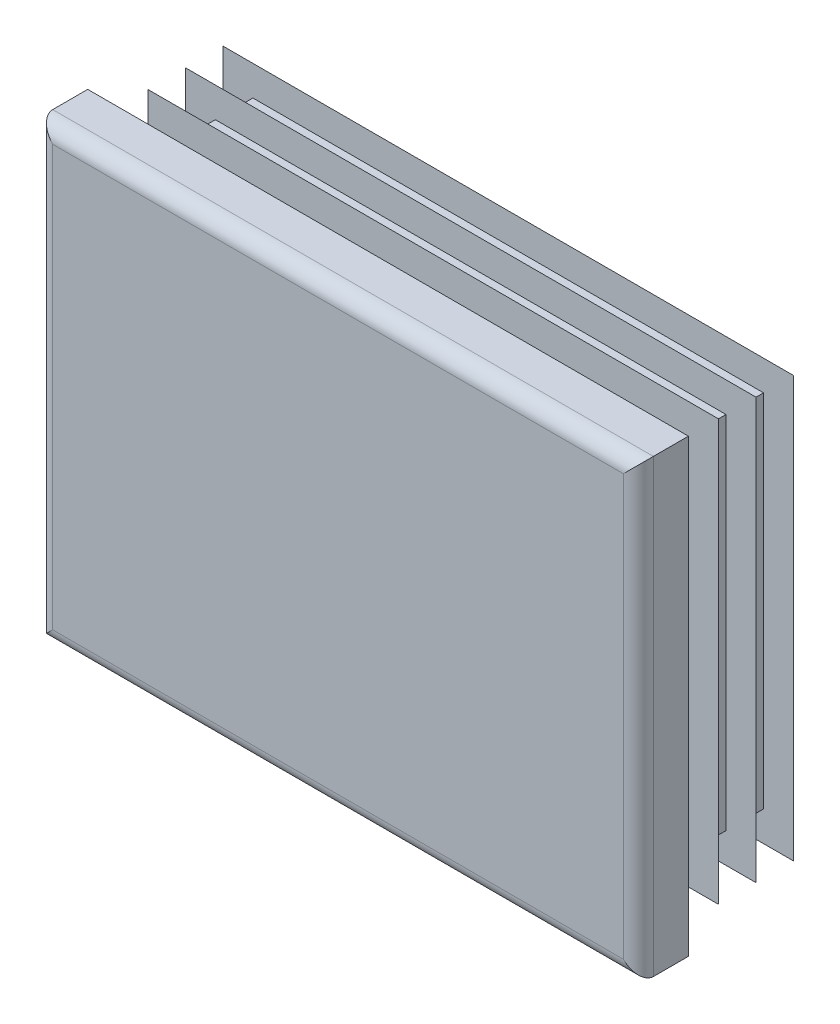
ISO-10303-21;
HEADER;
FILE_DESCRIPTION(('STEP AP214'),'2;1');
FILE_NAME('part.step','',(''),(''),'','','');
FILE_SCHEMA(('AUTOMOTIVE_DESIGN { 1 0 10303 214 1 1 1 1 }'));
ENDSEC;
DATA;
#1=APPLICATION_CONTEXT('core data for automotive mechanical design processes');
#2=APPLICATION_PROTOCOL_DEFINITION('international standard','automotive_design',2000,#1);
#3=PRODUCT_CONTEXT('',#1,'mechanical');
#4=PRODUCT('Part','Part','',(#3));
#5=PRODUCT_RELATED_PRODUCT_CATEGORY('part','',(#4));
#6=PRODUCT_DEFINITION_FORMATION('','',#4);
#7=PRODUCT_DEFINITION_CONTEXT('part definition',#1,'design');
#8=PRODUCT_DEFINITION('design','',#6,#7);
#9=PRODUCT_DEFINITION_SHAPE('','',#8);
#10=(LENGTH_UNIT() NAMED_UNIT(*) SI_UNIT(.MILLI.,.METRE.));
#11=(NAMED_UNIT(*) PLANE_ANGLE_UNIT() SI_UNIT($,.RADIAN.));
#12=(NAMED_UNIT(*) SI_UNIT($,.STERADIAN.) SOLID_ANGLE_UNIT());
#13=UNCERTAINTY_MEASURE_WITH_UNIT(LENGTH_MEASURE(1.E-05),#10,'distance_accuracy_value','');
#14=(GEOMETRIC_REPRESENTATION_CONTEXT(3) GLOBAL_UNCERTAINTY_ASSIGNED_CONTEXT((#13)) GLOBAL_UNIT_ASSIGNED_CONTEXT((#10,
#11,#12)) REPRESENTATION_CONTEXT('',''));
#15=CARTESIAN_POINT('',(0.,0.,0.));
#16=DIRECTION('',(0.,0.,1.));
#17=DIRECTION('',(1.,0.,0.));
#18=AXIS2_PLACEMENT_3D('',#15,#16,#17);
#19=CARTESIAN_POINT('',(28.5,-22.5,5.));
#20=DIRECTION('',(0.,0.,-1.));
#21=DIRECTION('',(0.,1.,0.));
#22=AXIS2_PLACEMENT_3D('',#19,#20,#21);
#23=PLANE('',#22);
#24=DIRECTION('',(0.,1.,0.));
#25=VECTOR('',#24,1.);
#26=CARTESIAN_POINT('',(-28.5,-22.5,5.));
#27=LINE('',#26,#25);
#28=CARTESIAN_POINT('',(-28.5,-21.,5.));
#29=VERTEX_POINT('',#28);
#30=CARTESIAN_POINT('',(-28.5,21.,5.));
#31=VERTEX_POINT('',#30);
#32=EDGE_CURVE('E310',#29,#31,#27,.T.);
#33=ORIENTED_EDGE('',*,*,#32,.F.);
#34=DIRECTION('',(-1.,0.,0.));
#35=VECTOR('',#34,1.);
#36=CARTESIAN_POINT('',(30.,-21.,5.));
#37=LINE('',#36,#35);
#38=CARTESIAN_POINT('',(28.5,-21.,5.));
#39=VERTEX_POINT('',#38);
#40=EDGE_CURVE('E482',#39,#29,#37,.T.);
#41=ORIENTED_EDGE('',*,*,#40,.F.);
#42=DIRECTION('',(0.,1.,0.));
#43=VECTOR('',#42,1.);
#44=CARTESIAN_POINT('',(28.5,-22.5,5.));
#45=LINE('',#44,#43);
#46=CARTESIAN_POINT('',(28.5,21.,5.));
#47=VERTEX_POINT('',#46);
#48=EDGE_CURVE('E305',#39,#47,#45,.T.);
#49=ORIENTED_EDGE('',*,*,#48,.T.);
#50=DIRECTION('',(-1.,0.,0.));
#51=VECTOR('',#50,1.);
#52=CARTESIAN_POINT('',(30.,21.,5.));
#53=LINE('',#52,#51);
#54=EDGE_CURVE('E630',#47,#31,#53,.T.);
#55=ORIENTED_EDGE('',*,*,#54,.T.);
#56=EDGE_LOOP('',(#33,#41,#49,#55));
#57=FACE_BOUND('',#56,.T.);
#58=ADVANCED_FACE('F14',(#57),#23,.F.);
#59=CARTESIAN_POINT('',(-28.5,-22.5,3.5));
#60=DIRECTION('',(0.,1.,0.));
#61=DIRECTION('',(-1.,0.,0.));
#62=AXIS2_PLACEMENT_3D('',#59,#60,#61);
#63=CYLINDRICAL_SURFACE('',#62,1.5);
#64=DIRECTION('',(0.,1.,0.));
#65=VECTOR('',#64,1.);
#66=CARTESIAN_POINT('',(-30.,-22.5,3.5));
#67=LINE('',#66,#65);
#68=CARTESIAN_POINT('',(-30.,-22.5,3.5));
#69=VERTEX_POINT('',#68);
#70=CARTESIAN_POINT('',(-30.,22.5,3.5));
#71=VERTEX_POINT('',#70);
#72=EDGE_CURVE('E402',#69,#71,#67,.T.);
#73=ORIENTED_EDGE('',*,*,#72,.F.);
#74=CARTESIAN_POINT('',(-28.5,-21.,3.5));
#75=DIRECTION('',(-0.707106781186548,0.707106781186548,0.));
#76=DIRECTION('',(0.707106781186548,0.707106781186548,0.));
#77=AXIS2_PLACEMENT_3D('',#74,#75,#76);
#78=ELLIPSE('',#77,2.12132034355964,1.5);
#79=EDGE_CURVE('E59',#69,#29,#78,.T.);
#80=ORIENTED_EDGE('',*,*,#79,.T.);
#81=ORIENTED_EDGE('',*,*,#32,.T.);
#82=CARTESIAN_POINT('',(-28.5,21.,3.5));
#83=DIRECTION('',(0.707106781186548,0.707106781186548,0.));
#84=DIRECTION('',(-0.707106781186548,0.707106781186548,0.));
#85=AXIS2_PLACEMENT_3D('',#82,#83,#84);
#86=ELLIPSE('',#85,2.12132034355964,1.5);
#87=EDGE_CURVE('E306',#31,#71,#86,.F.);
#88=ORIENTED_EDGE('',*,*,#87,.T.);
#89=EDGE_LOOP('',(#73,#80,#81,#88));
#90=FACE_BOUND('',#89,.T.);
#91=ADVANCED_FACE('F16',(#90),#63,.T.);
#92=CARTESIAN_POINT('',(-30.,-22.5,3.5));
#93=DIRECTION('',(1.,0.,0.));
#94=DIRECTION('',(0.,1.,0.));
#95=AXIS2_PLACEMENT_3D('',#92,#93,#94);
#96=PLANE('',#95);
#97=DIRECTION('',(0.,0.,-1.));
#98=VECTOR('',#97,1.);
#99=CARTESIAN_POINT('',(-30.,22.5,3.5));
#100=LINE('',#99,#98);
#101=CARTESIAN_POINT('',(-30.,22.5,0.));
#102=VERTEX_POINT('',#101);
#103=EDGE_CURVE('E615',#71,#102,#100,.T.);
#104=ORIENTED_EDGE('',*,*,#103,.T.);
#105=DIRECTION('',(0.,1.,0.));
#106=VECTOR('',#105,1.);
#107=CARTESIAN_POINT('',(-30.,-22.5,0.));
#108=LINE('',#107,#106);
#109=CARTESIAN_POINT('',(-30.,-22.5,0.));
#110=VERTEX_POINT('',#109);
#111=EDGE_CURVE('E400',#110,#102,#108,.T.);
#112=ORIENTED_EDGE('',*,*,#111,.F.);
#113=DIRECTION('',(0.,0.,-1.));
#114=VECTOR('',#113,1.);
#115=CARTESIAN_POINT('',(-30.,-22.5,3.5));
#116=LINE('',#115,#114);
#117=EDGE_CURVE('E616',#69,#110,#116,.T.);
#118=ORIENTED_EDGE('',*,*,#117,.F.);
#119=ORIENTED_EDGE('',*,*,#72,.T.);
#120=EDGE_LOOP('',(#104,#112,#118,#119));
#121=FACE_BOUND('',#120,.T.);
#122=ADVANCED_FACE('F697',(#121),#96,.F.);
#123=CARTESIAN_POINT('',(-25.5,-22.5,0.));
#124=DIRECTION('',(1.,0.,0.));
#125=DIRECTION('',(0.,1.,0.));
#126=AXIS2_PLACEMENT_3D('',#123,#124,#125);
#127=PLANE('',#126);
#128=DIRECTION('',(0.,1.,0.));
#129=VECTOR('',#128,1.);
#130=CARTESIAN_POINT('',(-25.5,-22.5,0.));
#131=LINE('',#130,#129);
#132=CARTESIAN_POINT('',(-25.5,-18.,0.));
#133=VERTEX_POINT('',#132);
#134=CARTESIAN_POINT('',(-25.5,18.,0.));
#135=VERTEX_POINT('',#134);
#136=EDGE_CURVE('E397',#133,#135,#131,.T.);
#137=ORIENTED_EDGE('',*,*,#136,.T.);
#138=DIRECTION('',(0.,0.,-1.));
#139=VECTOR('',#138,1.);
#140=CARTESIAN_POINT('',(-25.5,18.,0.));
#141=LINE('',#140,#139);
#142=CARTESIAN_POINT('',(-25.5,18.,-0.75));
#143=VERTEX_POINT('',#142);
#144=EDGE_CURVE('E495',#135,#143,#141,.T.);
#145=ORIENTED_EDGE('',*,*,#144,.T.);
#146=DIRECTION('',(0.,1.,0.));
#147=VECTOR('',#146,1.);
#148=CARTESIAN_POINT('',(-25.5,-22.5,-0.75));
#149=LINE('',#148,#147);
#150=CARTESIAN_POINT('',(-25.5,-18.,-0.75));
#151=VERTEX_POINT('',#150);
#152=EDGE_CURVE('E394',#151,#143,#149,.T.);
#153=ORIENTED_EDGE('',*,*,#152,.F.);
#154=DIRECTION('',(0.,0.,1.));
#155=VECTOR('',#154,1.);
#156=CARTESIAN_POINT('',(-25.5,-18.,0.));
#157=LINE('',#156,#155);
#158=EDGE_CURVE('E489',#151,#133,#157,.T.);
#159=ORIENTED_EDGE('',*,*,#158,.T.);
#160=EDGE_LOOP('',(#137,#145,#153,#159));
#161=FACE_BOUND('',#160,.T.);
#162=ADVANCED_FACE('F787',(#161),#127,.F.);
#163=CARTESIAN_POINT('',(-28.5,-22.5,-0.75));
#164=DIRECTION('',(0.342020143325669,0.,0.939692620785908));
#165=DIRECTION('',(-0.939692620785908,0.,0.342020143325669));
#166=AXIS2_PLACEMENT_3D('',#163,#164,#165);
#167=PLANE('',#166);
#168=DIRECTION('',(0.,1.,0.));
#169=VECTOR('',#168,1.);
#170=CARTESIAN_POINT('',(-28.5,-22.5,-0.75));
#171=LINE('',#170,#169);
#172=CARTESIAN_POINT('',(-28.5,-21.,-0.75));
#173=VERTEX_POINT('',#172);
#174=CARTESIAN_POINT('',(-28.5,21.,-0.75));
#175=VERTEX_POINT('',#174);
#176=EDGE_CURVE('E392',#173,#175,#171,.T.);
#177=ORIENTED_EDGE('',*,*,#176,.T.);
#178=DIRECTION('',(0.844349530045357,-0.438895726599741,-0.307318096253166));
#179=VECTOR('',#178,1.);
#180=CARTESIAN_POINT('',(-12.3797090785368,12.6206185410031,-6.6173060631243));
#181=LINE('',#180,#179);
#182=CARTESIAN_POINT('',(-25.5,19.4405899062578,-1.84191070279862));
#183=VERTEX_POINT('',#182);
#184=EDGE_CURVE('E519',#175,#183,#181,.T.);
#185=ORIENTED_EDGE('',*,*,#184,.T.);
#186=DIRECTION('',(0.,1.,0.));
#187=VECTOR('',#186,1.);
#188=CARTESIAN_POINT('',(-25.5,-22.5,-1.84191070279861));
#189=LINE('',#188,#187);
#190=CARTESIAN_POINT('',(-25.5,-19.4405899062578,-1.84191070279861));
#191=VERTEX_POINT('',#190);
#192=EDGE_CURVE('E389',#191,#183,#189,.T.);
#193=ORIENTED_EDGE('',*,*,#192,.F.);
#194=DIRECTION('',(-0.844349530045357,-0.438895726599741,0.307318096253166));
#195=VECTOR('',#194,1.);
#196=CARTESIAN_POINT('',(-29.0558721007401,-21.2889441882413,-0.547679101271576));
#197=LINE('',#196,#195);
#198=EDGE_CURVE('E507',#191,#173,#197,.T.);
#199=ORIENTED_EDGE('',*,*,#198,.T.);
#200=EDGE_LOOP('',(#177,#185,#193,#199));
#201=FACE_BOUND('',#200,.T.);
#202=ADVANCED_FACE('F783',(#201),#167,.F.);
#203=CARTESIAN_POINT('',(-25.5,-22.5,-1.84191070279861));
#204=DIRECTION('',(1.,0.,0.));
#205=DIRECTION('',(0.,1.,0.));
#206=AXIS2_PLACEMENT_3D('',#203,#204,#205);
#207=PLANE('',#206);
#208=ORIENTED_EDGE('',*,*,#192,.T.);
#209=DIRECTION('',(0.,-0.819152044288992,-0.573576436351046));
#210=VECTOR('',#209,1.);
#211=CARTESIAN_POINT('',(-25.5,-8.7019683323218,-21.5475421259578));
#212=LINE('',#211,#210);
#213=CARTESIAN_POINT('',(-25.5,18.,-2.85062261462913));
#214=VERTEX_POINT('',#213);
#215=EDGE_CURVE('E516',#183,#214,#212,.T.);
#216=ORIENTED_EDGE('',*,*,#215,.T.);
#217=DIRECTION('',(0.,0.,-1.));
#218=VECTOR('',#217,1.);
#219=CARTESIAN_POINT('',(-25.5,18.,-1.84191070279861));
#220=LINE('',#219,#218);
#221=CARTESIAN_POINT('',(-25.5,18.,-4.5));
#222=VERTEX_POINT('',#221);
#223=EDGE_CURVE('E525',#214,#222,#220,.T.);
#224=ORIENTED_EDGE('',*,*,#223,.T.);
#225=DIRECTION('',(0.,1.,0.));
#226=VECTOR('',#225,1.);
#227=CARTESIAN_POINT('',(-25.5,-22.5,-4.5));
#228=LINE('',#227,#226);
#229=CARTESIAN_POINT('',(-25.5,-18.,-4.5));
#230=VERTEX_POINT('',#229);
#231=EDGE_CURVE('E386',#230,#222,#228,.T.);
#232=ORIENTED_EDGE('',*,*,#231,.F.);
#233=DIRECTION('',(0.,0.,1.));
#234=VECTOR('',#233,1.);
#235=CARTESIAN_POINT('',(-25.5,-18.,-1.84191070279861));
#236=LINE('',#235,#234);
#237=CARTESIAN_POINT('',(-25.5,-18.,-2.85062261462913));
#238=VERTEX_POINT('',#237);
#239=EDGE_CURVE('E522',#230,#238,#236,.T.);
#240=ORIENTED_EDGE('',*,*,#239,.T.);
#241=DIRECTION('',(0.,-0.819152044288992,0.573576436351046));
#242=VECTOR('',#241,1.);
#243=CARTESIAN_POINT('',(-25.5,-21.4934848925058,-0.404458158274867));
#244=LINE('',#243,#242);
#245=EDGE_CURVE('E504',#238,#191,#244,.T.);
#246=ORIENTED_EDGE('',*,*,#245,.T.);
#247=EDGE_LOOP('',(#208,#216,#224,#232,#240,#246));
#248=FACE_BOUND('',#247,.T.);
#249=ADVANCED_FACE('F779',(#248),#207,.F.);
#250=CARTESIAN_POINT('',(-28.5,-22.5,-4.5));
#251=DIRECTION('',(0.342020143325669,0.,0.939692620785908));
#252=DIRECTION('',(-0.939692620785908,0.,0.342020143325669));
#253=AXIS2_PLACEMENT_3D('',#250,#251,#252);
#254=PLANE('',#253);
#255=DIRECTION('',(0.,1.,0.));
#256=VECTOR('',#255,1.);
#257=CARTESIAN_POINT('',(-28.5,-22.5,-4.5));
#258=LINE('',#257,#256);
#259=CARTESIAN_POINT('',(-28.5,-21.,-4.5));
#260=VERTEX_POINT('',#259);
#261=CARTESIAN_POINT('',(-28.5,21.,-4.5));
#262=VERTEX_POINT('',#261);
#263=EDGE_CURVE('E384',#260,#262,#258,.T.);
#264=ORIENTED_EDGE('',*,*,#263,.T.);
#265=DIRECTION('',(0.844349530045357,-0.438895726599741,-0.307318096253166));
#266=VECTOR('',#265,1.);
#267=CARTESIAN_POINT('',(-12.3797090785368,12.6206185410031,-10.3673060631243));
#268=LINE('',#267,#266);
#269=CARTESIAN_POINT('',(-25.5,19.4405899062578,-5.59191070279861));
#270=VERTEX_POINT('',#269);
#271=EDGE_CURVE('E549',#262,#270,#268,.T.);
#272=ORIENTED_EDGE('',*,*,#271,.T.);
#273=DIRECTION('',(0.,1.,0.));
#274=VECTOR('',#273,1.);
#275=CARTESIAN_POINT('',(-25.5,-22.5,-5.59191070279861));
#276=LINE('',#275,#274);
#277=CARTESIAN_POINT('',(-25.5,-19.4405899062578,-5.59191070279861));
#278=VERTEX_POINT('',#277);
#279=EDGE_CURVE('E381',#278,#270,#276,.T.);
#280=ORIENTED_EDGE('',*,*,#279,.F.);
#281=DIRECTION('',(-0.844349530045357,-0.43889572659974,0.307318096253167));
#282=VECTOR('',#281,1.);
#283=CARTESIAN_POINT('',(-29.0558721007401,-21.2889441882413,-4.29767910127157));
#284=LINE('',#283,#282);
#285=EDGE_CURVE('E537',#278,#260,#284,.T.);
#286=ORIENTED_EDGE('',*,*,#285,.T.);
#287=EDGE_LOOP('',(#264,#272,#280,#286));
#288=FACE_BOUND('',#287,.T.);
#289=ADVANCED_FACE('F775',(#288),#254,.F.);
#290=CARTESIAN_POINT('',(-25.5,-22.5,-5.59191070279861));
#291=DIRECTION('',(1.,0.,0.));
#292=DIRECTION('',(0.,1.,0.));
#293=AXIS2_PLACEMENT_3D('',#290,#291,#292);
#294=PLANE('',#293);
#295=ORIENTED_EDGE('',*,*,#279,.T.);
#296=DIRECTION('',(0.,-0.819152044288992,-0.573576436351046));
#297=VECTOR('',#296,1.);
#298=CARTESIAN_POINT('',(-25.5,-8.7019683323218,-25.2975421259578));
#299=LINE('',#298,#297);
#300=CARTESIAN_POINT('',(-25.5,18.,-6.60062261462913));
#301=VERTEX_POINT('',#300);
#302=EDGE_CURVE('E546',#270,#301,#299,.T.);
#303=ORIENTED_EDGE('',*,*,#302,.T.);
#304=DIRECTION('',(0.,0.,-1.));
#305=VECTOR('',#304,1.);
#306=CARTESIAN_POINT('',(-25.5,18.,-5.59191070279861));
#307=LINE('',#306,#305);
#308=CARTESIAN_POINT('',(-25.5,18.,-8.25));
#309=VERTEX_POINT('',#308);
#310=EDGE_CURVE('E555',#301,#309,#307,.T.);
#311=ORIENTED_EDGE('',*,*,#310,.T.);
#312=DIRECTION('',(0.,1.,0.));
#313=VECTOR('',#312,1.);
#314=CARTESIAN_POINT('',(-25.5,-22.5,-8.25));
#315=LINE('',#314,#313);
#316=CARTESIAN_POINT('',(-25.5,-18.,-8.25));
#317=VERTEX_POINT('',#316);
#318=EDGE_CURVE('E378',#317,#309,#315,.T.);
#319=ORIENTED_EDGE('',*,*,#318,.F.);
#320=DIRECTION('',(0.,0.,1.));
#321=VECTOR('',#320,1.);
#322=CARTESIAN_POINT('',(-25.5,-18.,-5.59191070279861));
#323=LINE('',#322,#321);
#324=CARTESIAN_POINT('',(-25.5,-18.,-6.60062261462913));
#325=VERTEX_POINT('',#324);
#326=EDGE_CURVE('E552',#317,#325,#323,.T.);
#327=ORIENTED_EDGE('',*,*,#326,.T.);
#328=DIRECTION('',(0.,-0.819152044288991,0.573576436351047));
#329=VECTOR('',#328,1.);
#330=CARTESIAN_POINT('',(-25.5,-21.4934848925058,-4.15445815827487));
#331=LINE('',#330,#329);
#332=EDGE_CURVE('E534',#325,#278,#331,.T.);
#333=ORIENTED_EDGE('',*,*,#332,.T.);
#334=EDGE_LOOP('',(#295,#303,#311,#319,#327,#333));
#335=FACE_BOUND('',#334,.T.);
#336=ADVANCED_FACE('F771',(#335),#294,.F.);
#337=CARTESIAN_POINT('',(-28.5,-22.5,-8.25));
#338=DIRECTION('',(0.342020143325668,0.,0.939692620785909));
#339=DIRECTION('',(-0.939692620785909,0.,0.342020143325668));
#340=AXIS2_PLACEMENT_3D('',#337,#338,#339);
#341=PLANE('',#340);
#342=DIRECTION('',(0.,1.,0.));
#343=VECTOR('',#342,1.);
#344=CARTESIAN_POINT('',(-28.5,-22.5,-8.25));
#345=LINE('',#344,#343);
#346=CARTESIAN_POINT('',(-28.5,-21.,-8.25));
#347=VERTEX_POINT('',#346);
#348=CARTESIAN_POINT('',(-28.5,21.,-8.25));
#349=VERTEX_POINT('',#348);
#350=EDGE_CURVE('E376',#347,#349,#345,.T.);
#351=ORIENTED_EDGE('',*,*,#350,.T.);
#352=DIRECTION('',(0.844349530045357,-0.43889572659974,-0.307318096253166));
#353=VECTOR('',#352,1.);
#354=CARTESIAN_POINT('',(-12.3797090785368,12.6206185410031,-14.1173060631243));
#355=LINE('',#354,#353);
#356=CARTESIAN_POINT('',(-25.5,19.4405899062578,-9.34191070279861));
#357=VERTEX_POINT('',#356);
#358=EDGE_CURVE('E579',#349,#357,#355,.T.);
#359=ORIENTED_EDGE('',*,*,#358,.T.);
#360=DIRECTION('',(0.,1.,0.));
#361=VECTOR('',#360,1.);
#362=CARTESIAN_POINT('',(-25.5,-22.5,-9.3419107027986));
#363=LINE('',#362,#361);
#364=CARTESIAN_POINT('',(-25.5,-19.4405899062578,-9.3419107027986));
#365=VERTEX_POINT('',#364);
#366=EDGE_CURVE('E373',#365,#357,#363,.T.);
#367=ORIENTED_EDGE('',*,*,#366,.F.);
#368=DIRECTION('',(-0.844349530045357,-0.43889572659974,0.307318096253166));
#369=VECTOR('',#368,1.);
#370=CARTESIAN_POINT('',(-29.0558721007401,-21.2889441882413,-8.04767910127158));
#371=LINE('',#370,#369);
#372=EDGE_CURVE('E567',#365,#347,#371,.T.);
#373=ORIENTED_EDGE('',*,*,#372,.T.);
#374=EDGE_LOOP('',(#351,#359,#367,#373));
#375=FACE_BOUND('',#374,.T.);
#376=ADVANCED_FACE('F767',(#375),#341,.F.);
#377=CARTESIAN_POINT('',(-25.5,-22.5,-9.3419107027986));
#378=DIRECTION('',(1.,0.,0.));
#379=DIRECTION('',(0.,1.,0.));
#380=AXIS2_PLACEMENT_3D('',#377,#378,#379);
#381=PLANE('',#380);
#382=ORIENTED_EDGE('',*,*,#366,.T.);
#383=DIRECTION('',(0.,-0.819152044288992,-0.573576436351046));
#384=VECTOR('',#383,1.);
#385=CARTESIAN_POINT('',(-25.5,-8.70196833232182,-29.0475421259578));
#386=LINE('',#385,#384);
#387=CARTESIAN_POINT('',(-25.5,18.,-10.3506226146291));
#388=VERTEX_POINT('',#387);
#389=EDGE_CURVE('E576',#357,#388,#386,.T.);
#390=ORIENTED_EDGE('',*,*,#389,.T.);
#391=DIRECTION('',(0.,0.,-1.));
#392=VECTOR('',#391,1.);
#393=CARTESIAN_POINT('',(-25.5,18.,-9.3419107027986));
#394=LINE('',#393,#392);
#395=CARTESIAN_POINT('',(-25.5,18.,-12.));
#396=VERTEX_POINT('',#395);
#397=EDGE_CURVE('E585',#388,#396,#394,.T.);
#398=ORIENTED_EDGE('',*,*,#397,.T.);
#399=DIRECTION('',(0.,1.,0.));
#400=VECTOR('',#399,1.);
#401=CARTESIAN_POINT('',(-25.5,-22.5,-12.));
#402=LINE('',#401,#400);
#403=CARTESIAN_POINT('',(-25.5,-18.,-12.));
#404=VERTEX_POINT('',#403);
#405=EDGE_CURVE('E370',#404,#396,#402,.T.);
#406=ORIENTED_EDGE('',*,*,#405,.F.);
#407=DIRECTION('',(0.,0.,1.));
#408=VECTOR('',#407,1.);
#409=CARTESIAN_POINT('',(-25.5,-18.,-9.3419107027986));
#410=LINE('',#409,#408);
#411=CARTESIAN_POINT('',(-25.5,-18.,-10.3506226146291));
#412=VERTEX_POINT('',#411);
#413=EDGE_CURVE('E582',#404,#412,#410,.T.);
#414=ORIENTED_EDGE('',*,*,#413,.T.);
#415=DIRECTION('',(0.,-0.819152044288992,0.573576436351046));
#416=VECTOR('',#415,1.);
#417=CARTESIAN_POINT('',(-25.5,-21.4934848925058,-7.90445815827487));
#418=LINE('',#417,#416);
#419=EDGE_CURVE('E564',#412,#365,#418,.T.);
#420=ORIENTED_EDGE('',*,*,#419,.T.);
#421=EDGE_LOOP('',(#382,#390,#398,#406,#414,#420));
#422=FACE_BOUND('',#421,.T.);
#423=ADVANCED_FACE('F764',(#422),#381,.F.);
#424=CARTESIAN_POINT('',(-28.5,-22.5,-12.));
#425=DIRECTION('',(0.342020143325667,0.,0.939692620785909));
#426=DIRECTION('',(-0.939692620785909,0.,0.342020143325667));
#427=AXIS2_PLACEMENT_3D('',#424,#425,#426);
#428=PLANE('',#427);
#429=DIRECTION('',(0.,1.,0.));
#430=VECTOR('',#429,1.);
#431=CARTESIAN_POINT('',(-28.5,-22.5,-12.));
#432=LINE('',#431,#430);
#433=CARTESIAN_POINT('',(-28.5,-21.,-12.));
#434=VERTEX_POINT('',#433);
#435=CARTESIAN_POINT('',(-28.5,21.,-12.));
#436=VERTEX_POINT('',#435);
#437=EDGE_CURVE('E368',#434,#436,#432,.T.);
#438=ORIENTED_EDGE('',*,*,#437,.T.);
#439=DIRECTION('',(0.844349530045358,-0.438895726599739,-0.307318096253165));
#440=VECTOR('',#439,1.);
#441=CARTESIAN_POINT('',(-12.3797090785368,12.6206185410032,-17.8673060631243));
#442=LINE('',#441,#440);
#443=CARTESIAN_POINT('',(-25.5,19.4405899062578,-13.0919107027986));
#444=VERTEX_POINT('',#443);
#445=EDGE_CURVE('E607',#436,#444,#442,.T.);
#446=ORIENTED_EDGE('',*,*,#445,.T.);
#447=DIRECTION('',(0.,1.,0.));
#448=VECTOR('',#447,1.);
#449=CARTESIAN_POINT('',(-25.5,-22.5,-13.0919107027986));
#450=LINE('',#449,#448);
#451=CARTESIAN_POINT('',(-25.5,-19.4405899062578,-13.0919107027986));
#452=VERTEX_POINT('',#451);
#453=EDGE_CURVE('E365',#452,#444,#450,.T.);
#454=ORIENTED_EDGE('',*,*,#453,.F.);
#455=DIRECTION('',(-0.844349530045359,-0.438895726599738,0.307318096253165));
#456=VECTOR('',#455,1.);
#457=CARTESIAN_POINT('',(-29.0558721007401,-21.2889441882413,-11.7976791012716));
#458=LINE('',#457,#456);
#459=EDGE_CURVE('E595',#452,#434,#458,.T.);
#460=ORIENTED_EDGE('',*,*,#459,.T.);
#461=EDGE_LOOP('',(#438,#446,#454,#460));
#462=FACE_BOUND('',#461,.T.);
#463=ADVANCED_FACE('F675',(#462),#428,.F.);
#464=CARTESIAN_POINT('',(-25.5,-22.5,-13.0919107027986));
#465=DIRECTION('',(1.,0.,0.));
#466=DIRECTION('',(0.,1.,0.));
#467=AXIS2_PLACEMENT_3D('',#464,#465,#466);
#468=PLANE('',#467);
#469=ORIENTED_EDGE('',*,*,#453,.T.);
#470=DIRECTION('',(0.,-0.819152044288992,-0.573576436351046));
#471=VECTOR('',#470,1.);
#472=CARTESIAN_POINT('',(-25.5,-8.7019683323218,-32.7975421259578));
#473=LINE('',#472,#471);
#474=CARTESIAN_POINT('',(-25.5,18.,-14.1006226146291));
#475=VERTEX_POINT('',#474);
#476=EDGE_CURVE('E604',#444,#475,#473,.T.);
#477=ORIENTED_EDGE('',*,*,#476,.T.);
#478=DIRECTION('',(0.,0.,-1.));
#479=VECTOR('',#478,1.);
#480=CARTESIAN_POINT('',(-25.5,18.,-13.0919107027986));
#481=LINE('',#480,#479);
#482=CARTESIAN_POINT('',(-25.5,18.,-15.));
#483=VERTEX_POINT('',#482);
#484=EDGE_CURVE('E613',#475,#483,#481,.T.);
#485=ORIENTED_EDGE('',*,*,#484,.T.);
#486=DIRECTION('',(0.,1.,0.));
#487=VECTOR('',#486,1.);
#488=CARTESIAN_POINT('',(-25.5,-22.5,-15.));
#489=LINE('',#488,#487);
#490=CARTESIAN_POINT('',(-25.5,-18.,-15.));
#491=VERTEX_POINT('',#490);
#492=EDGE_CURVE('E362',#491,#483,#489,.T.);
#493=ORIENTED_EDGE('',*,*,#492,.F.);
#494=DIRECTION('',(0.,0.,1.));
#495=VECTOR('',#494,1.);
#496=CARTESIAN_POINT('',(-25.5,-18.,-13.0919107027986));
#497=LINE('',#496,#495);
#498=CARTESIAN_POINT('',(-25.5,-18.,-14.1006226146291));
#499=VERTEX_POINT('',#498);
#500=EDGE_CURVE('E610',#491,#499,#497,.T.);
#501=ORIENTED_EDGE('',*,*,#500,.T.);
#502=DIRECTION('',(0.,-0.819152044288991,0.573576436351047));
#503=VECTOR('',#502,1.);
#504=CARTESIAN_POINT('',(-25.5,-21.4934848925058,-11.6544581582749));
#505=LINE('',#504,#503);
#506=EDGE_CURVE('E592',#499,#452,#505,.T.);
#507=ORIENTED_EDGE('',*,*,#506,.T.);
#508=EDGE_LOOP('',(#469,#477,#485,#493,#501,#507));
#509=FACE_BOUND('',#508,.T.);
#510=ADVANCED_FACE('F677',(#509),#468,.F.);
#511=CARTESIAN_POINT('',(-25.5,-22.5,-15.));
#512=DIRECTION('',(0.,0.,1.));
#513=DIRECTION('',(0.,-1.,0.));
#514=AXIS2_PLACEMENT_3D('',#511,#512,#513);
#515=PLANE('',#514);
#516=ORIENTED_EDGE('',*,*,#492,.T.);
#517=DIRECTION('',(-1.,0.,0.));
#518=VECTOR('',#517,1.);
#519=CARTESIAN_POINT('',(30.,18.,-15.));
#520=LINE('',#519,#518);
#521=CARTESIAN_POINT('',(25.5,18.,-15.));
#522=VERTEX_POINT('',#521);
#523=EDGE_CURVE('E438',#522,#483,#520,.T.);
#524=ORIENTED_EDGE('',*,*,#523,.F.);
#525=DIRECTION('',(0.,1.,0.));
#526=VECTOR('',#525,1.);
#527=CARTESIAN_POINT('',(25.5,-22.5,-15.));
#528=LINE('',#527,#526);
#529=CARTESIAN_POINT('',(25.5,-18.,-15.));
#530=VERTEX_POINT('',#529);
#531=EDGE_CURVE('E359',#530,#522,#528,.T.);
#532=ORIENTED_EDGE('',*,*,#531,.F.);
#533=DIRECTION('',(-1.,0.,0.));
#534=VECTOR('',#533,1.);
#535=CARTESIAN_POINT('',(30.,-18.,-15.));
#536=LINE('',#535,#534);
#537=EDGE_CURVE('E436',#530,#491,#536,.T.);
#538=ORIENTED_EDGE('',*,*,#537,.T.);
#539=EDGE_LOOP('',(#516,#524,#532,#538));
#540=FACE_BOUND('',#539,.T.);
#541=ADVANCED_FACE('F435',(#540),#515,.F.);
#542=CARTESIAN_POINT('',(25.5,-22.5,-15.));
#543=DIRECTION('',(-1.,0.,0.));
#544=DIRECTION('',(0.,-1.,0.));
#545=AXIS2_PLACEMENT_3D('',#542,#543,#544);
#546=PLANE('',#545);
#547=DIRECTION('',(0.,0.,1.));
#548=VECTOR('',#547,1.);
#549=CARTESIAN_POINT('',(25.5,18.,-15.));
#550=LINE('',#549,#548);
#551=CARTESIAN_POINT('',(25.5,18.,-14.1006226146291));
#552=VERTEX_POINT('',#551);
#553=EDGE_CURVE('E9',#522,#552,#550,.T.);
#554=ORIENTED_EDGE('',*,*,#553,.T.);
#555=DIRECTION('',(0.,0.819152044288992,0.573576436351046));
#556=VECTOR('',#555,1.);
#557=CARTESIAN_POINT('',(25.5,-9.59847704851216,-33.425284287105));
#558=LINE('',#557,#556);
#559=CARTESIAN_POINT('',(25.5,19.4405899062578,-13.0919107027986));
#560=VERTEX_POINT('',#559);
#561=EDGE_CURVE('E601',#552,#560,#558,.T.);
#562=ORIENTED_EDGE('',*,*,#561,.T.);
#563=DIRECTION('',(0.,1.,0.));
#564=VECTOR('',#563,1.);
#565=CARTESIAN_POINT('',(25.5,-22.5,-13.0919107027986));
#566=LINE('',#565,#564);
#567=CARTESIAN_POINT('',(25.5,-19.4405899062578,-13.0919107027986));
#568=VERTEX_POINT('',#567);
#569=EDGE_CURVE('E356',#568,#560,#566,.T.);
#570=ORIENTED_EDGE('',*,*,#569,.F.);
#571=DIRECTION('',(0.,0.819152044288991,-0.573576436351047));
#572=VECTOR('',#571,1.);
#573=CARTESIAN_POINT('',(25.5,-20.5969761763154,-12.2822003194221));
#574=LINE('',#573,#572);
#575=CARTESIAN_POINT('',(25.5,-18.,-14.1006226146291));
#576=VERTEX_POINT('',#575);
#577=EDGE_CURVE('E428',#568,#576,#574,.T.);
#578=ORIENTED_EDGE('',*,*,#577,.T.);
#579=DIRECTION('',(0.,0.,-1.));
#580=VECTOR('',#579,1.);
#581=CARTESIAN_POINT('',(25.5,-18.,-15.));
#582=LINE('',#581,#580);
#583=EDGE_CURVE('E23',#576,#530,#582,.T.);
#584=ORIENTED_EDGE('',*,*,#583,.T.);
#585=ORIENTED_EDGE('',*,*,#531,.T.);
#586=EDGE_LOOP('',(#554,#562,#570,#578,#584,#585));
#587=FACE_BOUND('',#586,.T.);
#588=ADVANCED_FACE('F426',(#587),#546,.F.);
#589=CARTESIAN_POINT('',(25.5,-22.5,-13.0919107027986));
#590=DIRECTION('',(-0.342020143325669,0.,0.939692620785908));
#591=DIRECTION('',(-0.939692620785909,0.,-0.342020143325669));
#592=AXIS2_PLACEMENT_3D('',#589,#590,#591);
#593=PLANE('',#592);
#594=ORIENTED_EDGE('',*,*,#569,.T.);
#595=DIRECTION('',(0.844349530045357,0.438895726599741,0.307318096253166));
#596=VECTOR('',#595,1.);
#597=CARTESIAN_POINT('',(9.95759745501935,11.3615967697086,-18.7488825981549));
#598=LINE('',#597,#596);
#599=CARTESIAN_POINT('',(28.5,21.,-12.));
#600=VERTEX_POINT('',#599);
#601=EDGE_CURVE('E598',#560,#600,#598,.T.);
#602=ORIENTED_EDGE('',*,*,#601,.T.);
#603=DIRECTION('',(0.,1.,0.));
#604=VECTOR('',#603,1.);
#605=CARTESIAN_POINT('',(28.5,-22.5,-12.));
#606=LINE('',#605,#604);
#607=CARTESIAN_POINT('',(28.5,-21.,-12.));
#608=VERTEX_POINT('',#607);
#609=EDGE_CURVE('E353',#608,#600,#606,.T.);
#610=ORIENTED_EDGE('',*,*,#609,.F.);
#611=DIRECTION('',(-0.844349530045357,0.43889572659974,-0.307318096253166));
#612=VECTOR('',#611,1.);
#613=CARTESIAN_POINT('',(26.6337604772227,-20.0299224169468,-12.6792556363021));
#614=LINE('',#613,#612);
#615=EDGE_CURVE('E588',#608,#568,#614,.T.);
#616=ORIENTED_EDGE('',*,*,#615,.T.);
#617=EDGE_LOOP('',(#594,#602,#610,#616));
#618=FACE_BOUND('',#617,.T.);
#619=ADVANCED_FACE('F752',(#618),#593,.F.);
#620=CARTESIAN_POINT('',(28.5,-22.5,-12.));
#621=DIRECTION('',(0.,0.,-1.));
#622=DIRECTION('',(0.,1.,0.));
#623=AXIS2_PLACEMENT_3D('',#620,#621,#622);
#624=PLANE('',#623);
#625=ORIENTED_EDGE('',*,*,#609,.T.);
#626=DIRECTION('',(-1.,0.,0.));
#627=VECTOR('',#626,1.);
#628=CARTESIAN_POINT('',(30.,21.,-12.));
#629=LINE('',#628,#627);
#630=EDGE_CURVE('E444',#600,#436,#629,.T.);
#631=ORIENTED_EDGE('',*,*,#630,.T.);
#632=ORIENTED_EDGE('',*,*,#437,.F.);
#633=DIRECTION('',(-1.,0.,0.));
#634=VECTOR('',#633,1.);
#635=CARTESIAN_POINT('',(30.,-21.,-12.));
#636=LINE('',#635,#634);
#637=EDGE_CURVE('E451',#608,#434,#636,.T.);
#638=ORIENTED_EDGE('',*,*,#637,.F.);
#639=EDGE_LOOP('',(#625,#631,#632,#638));
#640=FACE_BOUND('',#639,.T.);
#641=ORIENTED_EDGE('',*,*,#405,.T.);
#642=DIRECTION('',(-1.,0.,0.));
#643=VECTOR('',#642,1.);
#644=CARTESIAN_POINT('',(30.,18.,-12.));
#645=LINE('',#644,#643);
#646=CARTESIAN_POINT('',(25.5,18.,-12.));
#647=VERTEX_POINT('',#646);
#648=EDGE_CURVE('E663',#647,#396,#645,.T.);
#649=ORIENTED_EDGE('',*,*,#648,.F.);
#650=DIRECTION('',(0.,1.,0.));
#651=VECTOR('',#650,1.);
#652=CARTESIAN_POINT('',(25.5,-22.5,-12.));
#653=LINE('',#652,#651);
#654=CARTESIAN_POINT('',(25.5,-18.,-12.));
#655=VERTEX_POINT('',#654);
#656=EDGE_CURVE('E350',#655,#647,#653,.T.);
#657=ORIENTED_EDGE('',*,*,#656,.F.);
#658=DIRECTION('',(-1.,0.,0.));
#659=VECTOR('',#658,1.);
#660=CARTESIAN_POINT('',(30.,-18.,-12.));
#661=LINE('',#660,#659);
#662=EDGE_CURVE('E453',#655,#404,#661,.T.);
#663=ORIENTED_EDGE('',*,*,#662,.T.);
#664=EDGE_LOOP('',(#641,#649,#657,#663));
#665=FACE_BOUND('',#664,.T.);
#666=ADVANCED_FACE('F667',(#640,#665),#624,.F.);
#667=CARTESIAN_POINT('',(25.5,-22.5,-12.));
#668=DIRECTION('',(-1.,0.,0.));
#669=DIRECTION('',(0.,-1.,0.));
#670=AXIS2_PLACEMENT_3D('',#667,#668,#669);
#671=PLANE('',#670);
#672=DIRECTION('',(0.,0.,1.));
#673=VECTOR('',#672,1.);
#674=CARTESIAN_POINT('',(25.5,18.,-12.));
#675=LINE('',#674,#673);
#676=CARTESIAN_POINT('',(25.5,18.,-10.3506226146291));
#677=VERTEX_POINT('',#676);
#678=EDGE_CURVE('E420',#647,#677,#675,.T.);
#679=ORIENTED_EDGE('',*,*,#678,.T.);
#680=DIRECTION('',(0.,0.819152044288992,0.573576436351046));
#681=VECTOR('',#680,1.);
#682=CARTESIAN_POINT('',(25.5,-9.95086178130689,-29.9220267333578));
#683=LINE('',#682,#681);
#684=CARTESIAN_POINT('',(25.5,19.4405899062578,-9.34191070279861));
#685=VERTEX_POINT('',#684);
#686=EDGE_CURVE('E573',#677,#685,#683,.T.);
#687=ORIENTED_EDGE('',*,*,#686,.T.);
#688=DIRECTION('',(0.,1.,0.));
#689=VECTOR('',#688,1.);
#690=CARTESIAN_POINT('',(25.5,-22.5,-9.34191070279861));
#691=LINE('',#690,#689);
#692=CARTESIAN_POINT('',(25.5,-19.4405899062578,-9.34191070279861));
#693=VERTEX_POINT('',#692);
#694=EDGE_CURVE('E347',#693,#685,#691,.T.);
#695=ORIENTED_EDGE('',*,*,#694,.F.);
#696=DIRECTION('',(0.,0.819152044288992,-0.573576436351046));
#697=VECTOR('',#696,1.);
#698=CARTESIAN_POINT('',(25.5,-20.2445914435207,-8.77894276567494));
#699=LINE('',#698,#697);
#700=CARTESIAN_POINT('',(25.5,-18.,-10.3506226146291));
#701=VERTEX_POINT('',#700);
#702=EDGE_CURVE('E561',#693,#701,#699,.T.);
#703=ORIENTED_EDGE('',*,*,#702,.T.);
#704=DIRECTION('',(0.,0.,-1.));
#705=VECTOR('',#704,1.);
#706=CARTESIAN_POINT('',(25.5,-18.,-12.));
#707=LINE('',#706,#705);
#708=EDGE_CURVE('E417',#701,#655,#707,.T.);
#709=ORIENTED_EDGE('',*,*,#708,.T.);
#710=ORIENTED_EDGE('',*,*,#656,.T.);
#711=EDGE_LOOP('',(#679,#687,#695,#703,#709,#710));
#712=FACE_BOUND('',#711,.T.);
#713=ADVANCED_FACE('F745',(#712),#671,.F.);
#714=CARTESIAN_POINT('',(25.5,-22.5,-9.34191070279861));
#715=DIRECTION('',(-0.342020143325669,0.,0.939692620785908));
#716=DIRECTION('',(-0.939692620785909,0.,-0.342020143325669));
#717=AXIS2_PLACEMENT_3D('',#714,#715,#716);
#718=PLANE('',#717);
#719=ORIENTED_EDGE('',*,*,#694,.T.);
#720=DIRECTION('',(0.844349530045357,0.438895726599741,0.307318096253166));
#721=VECTOR('',#720,1.);
#722=CARTESIAN_POINT('',(9.95759745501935,11.3615967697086,-14.9988825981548));
#723=LINE('',#722,#721);
#724=CARTESIAN_POINT('',(28.5,21.,-8.25));
#725=VERTEX_POINT('',#724);
#726=EDGE_CURVE('E570',#685,#725,#723,.T.);
#727=ORIENTED_EDGE('',*,*,#726,.T.);
#728=DIRECTION('',(0.,1.,0.));
#729=VECTOR('',#728,1.);
#730=CARTESIAN_POINT('',(28.5,-22.5,-8.25));
#731=LINE('',#730,#729);
#732=CARTESIAN_POINT('',(28.5,-21.,-8.25));
#733=VERTEX_POINT('',#732);
#734=EDGE_CURVE('E344',#733,#725,#731,.T.);
#735=ORIENTED_EDGE('',*,*,#734,.F.);
#736=DIRECTION('',(-0.844349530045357,0.438895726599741,-0.307318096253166));
#737=VECTOR('',#736,1.);
#738=CARTESIAN_POINT('',(26.6337604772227,-20.0299224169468,-8.92925563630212));
#739=LINE('',#738,#737);
#740=EDGE_CURVE('E558',#733,#693,#739,.T.);
#741=ORIENTED_EDGE('',*,*,#740,.T.);
#742=EDGE_LOOP('',(#719,#727,#735,#741));
#743=FACE_BOUND('',#742,.T.);
#744=ADVANCED_FACE('F741',(#743),#718,.F.);
#745=CARTESIAN_POINT('',(28.5,-22.5,-8.25));
#746=DIRECTION('',(0.,0.,-1.));
#747=DIRECTION('',(0.,1.,0.));
#748=AXIS2_PLACEMENT_3D('',#745,#746,#747);
#749=PLANE('',#748);
#750=ORIENTED_EDGE('',*,*,#734,.T.);
#751=DIRECTION('',(-1.,0.,0.));
#752=VECTOR('',#751,1.);
#753=CARTESIAN_POINT('',(30.,21.,-8.25));
#754=LINE('',#753,#752);
#755=EDGE_CURVE('E657',#725,#349,#754,.T.);
#756=ORIENTED_EDGE('',*,*,#755,.T.);
#757=ORIENTED_EDGE('',*,*,#350,.F.);
#758=DIRECTION('',(-1.,0.,0.));
#759=VECTOR('',#758,1.);
#760=CARTESIAN_POINT('',(30.,-21.,-8.25));
#761=LINE('',#760,#759);
#762=EDGE_CURVE('E459',#733,#347,#761,.T.);
#763=ORIENTED_EDGE('',*,*,#762,.F.);
#764=EDGE_LOOP('',(#750,#756,#757,#763));
#765=FACE_BOUND('',#764,.T.);
#766=ORIENTED_EDGE('',*,*,#318,.T.);
#767=DIRECTION('',(-1.,0.,0.));
#768=VECTOR('',#767,1.);
#769=CARTESIAN_POINT('',(30.,18.,-8.25));
#770=LINE('',#769,#768);
#771=CARTESIAN_POINT('',(25.5,18.,-8.25));
#772=VERTEX_POINT('',#771);
#773=EDGE_CURVE('E655',#772,#309,#770,.T.);
#774=ORIENTED_EDGE('',*,*,#773,.F.);
#775=DIRECTION('',(0.,1.,0.));
#776=VECTOR('',#775,1.);
#777=CARTESIAN_POINT('',(25.5,-22.5,-8.25));
#778=LINE('',#777,#776);
#779=CARTESIAN_POINT('',(25.5,-18.,-8.25));
#780=VERTEX_POINT('',#779);
#781=EDGE_CURVE('E341',#780,#772,#778,.T.);
#782=ORIENTED_EDGE('',*,*,#781,.F.);
#783=DIRECTION('',(-1.,0.,0.));
#784=VECTOR('',#783,1.);
#785=CARTESIAN_POINT('',(30.,-18.,-8.25));
#786=LINE('',#785,#784);
#787=EDGE_CURVE('E461',#780,#317,#786,.T.);
#788=ORIENTED_EDGE('',*,*,#787,.T.);
#789=EDGE_LOOP('',(#766,#774,#782,#788));
#790=FACE_BOUND('',#789,.T.);
#791=ADVANCED_FACE('F737',(#765,#790),#749,.F.);
#792=CARTESIAN_POINT('',(25.5,-22.5,-8.25));
#793=DIRECTION('',(-1.,0.,0.));
#794=DIRECTION('',(0.,-1.,0.));
#795=AXIS2_PLACEMENT_3D('',#792,#793,#794);
#796=PLANE('',#795);
#797=DIRECTION('',(0.,0.,1.));
#798=VECTOR('',#797,1.);
#799=CARTESIAN_POINT('',(25.5,18.,-8.25));
#800=LINE('',#799,#798);
#801=CARTESIAN_POINT('',(25.5,18.,-6.60062261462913));
#802=VERTEX_POINT('',#801);
#803=EDGE_CURVE('E414',#772,#802,#800,.T.);
#804=ORIENTED_EDGE('',*,*,#803,.T.);
#805=DIRECTION('',(0.,0.819152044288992,0.573576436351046));
#806=VECTOR('',#805,1.);
#807=CARTESIAN_POINT('',(25.5,-9.95086178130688,-26.1720267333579));
#808=LINE('',#807,#806);
#809=CARTESIAN_POINT('',(25.5,19.4405899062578,-5.59191070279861));
#810=VERTEX_POINT('',#809);
#811=EDGE_CURVE('E543',#802,#810,#808,.T.);
#812=ORIENTED_EDGE('',*,*,#811,.T.);
#813=DIRECTION('',(0.,1.,0.));
#814=VECTOR('',#813,1.);
#815=CARTESIAN_POINT('',(25.5,-22.5,-5.59191070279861));
#816=LINE('',#815,#814);
#817=CARTESIAN_POINT('',(25.5,-19.4405899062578,-5.59191070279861));
#818=VERTEX_POINT('',#817);
#819=EDGE_CURVE('E338',#818,#810,#816,.T.);
#820=ORIENTED_EDGE('',*,*,#819,.F.);
#821=DIRECTION('',(0.,0.819152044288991,-0.573576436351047));
#822=VECTOR('',#821,1.);
#823=CARTESIAN_POINT('',(25.5,-20.2445914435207,-5.02894276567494));
#824=LINE('',#823,#822);
#825=CARTESIAN_POINT('',(25.5,-18.,-6.60062261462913));
#826=VERTEX_POINT('',#825);
#827=EDGE_CURVE('E531',#818,#826,#824,.T.);
#828=ORIENTED_EDGE('',*,*,#827,.T.);
#829=DIRECTION('',(0.,0.,-1.));
#830=VECTOR('',#829,1.);
#831=CARTESIAN_POINT('',(25.5,-18.,-8.25));
#832=LINE('',#831,#830);
#833=EDGE_CURVE('E411',#826,#780,#832,.T.);
#834=ORIENTED_EDGE('',*,*,#833,.T.);
#835=ORIENTED_EDGE('',*,*,#781,.T.);
#836=EDGE_LOOP('',(#804,#812,#820,#828,#834,#835));
#837=FACE_BOUND('',#836,.T.);
#838=ADVANCED_FACE('F733',(#837),#796,.F.);
#839=CARTESIAN_POINT('',(25.5,-22.5,-5.59191070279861));
#840=DIRECTION('',(-0.342020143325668,0.,0.939692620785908));
#841=DIRECTION('',(-0.939692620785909,0.,-0.342020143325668));
#842=AXIS2_PLACEMENT_3D('',#839,#840,#841);
#843=PLANE('',#842);
#844=ORIENTED_EDGE('',*,*,#819,.T.);
#845=DIRECTION('',(0.844349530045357,0.438895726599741,0.307318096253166));
#846=VECTOR('',#845,1.);
#847=CARTESIAN_POINT('',(9.95759745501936,11.3615967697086,-11.2488825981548));
#848=LINE('',#847,#846);
#849=CARTESIAN_POINT('',(28.5,21.,-4.5));
#850=VERTEX_POINT('',#849);
#851=EDGE_CURVE('E540',#810,#850,#848,.T.);
#852=ORIENTED_EDGE('',*,*,#851,.T.);
#853=DIRECTION('',(0.,1.,0.));
#854=VECTOR('',#853,1.);
#855=CARTESIAN_POINT('',(28.5,-22.5,-4.5));
#856=LINE('',#855,#854);
#857=CARTESIAN_POINT('',(28.5,-21.,-4.5));
#858=VERTEX_POINT('',#857);
#859=EDGE_CURVE('E335',#858,#850,#856,.T.);
#860=ORIENTED_EDGE('',*,*,#859,.F.);
#861=DIRECTION('',(-0.844349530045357,0.43889572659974,-0.307318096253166));
#862=VECTOR('',#861,1.);
#863=CARTESIAN_POINT('',(26.6337604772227,-20.0299224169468,-5.17925563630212));
#864=LINE('',#863,#862);
#865=EDGE_CURVE('E528',#858,#818,#864,.T.);
#866=ORIENTED_EDGE('',*,*,#865,.T.);
#867=EDGE_LOOP('',(#844,#852,#860,#866));
#868=FACE_BOUND('',#867,.T.);
#869=ADVANCED_FACE('F729',(#868),#843,.F.);
#870=CARTESIAN_POINT('',(28.5,-22.5,-4.5));
#871=DIRECTION('',(0.,0.,-1.));
#872=DIRECTION('',(0.,1.,0.));
#873=AXIS2_PLACEMENT_3D('',#870,#871,#872);
#874=PLANE('',#873);
#875=ORIENTED_EDGE('',*,*,#859,.T.);
#876=DIRECTION('',(-1.,0.,0.));
#877=VECTOR('',#876,1.);
#878=CARTESIAN_POINT('',(30.,21.,-4.5));
#879=LINE('',#878,#877);
#880=EDGE_CURVE('E649',#850,#262,#879,.T.);
#881=ORIENTED_EDGE('',*,*,#880,.T.);
#882=ORIENTED_EDGE('',*,*,#263,.F.);
#883=DIRECTION('',(-1.,0.,0.));
#884=VECTOR('',#883,1.);
#885=CARTESIAN_POINT('',(30.,-21.,-4.5));
#886=LINE('',#885,#884);
#887=EDGE_CURVE('E467',#858,#260,#886,.T.);
#888=ORIENTED_EDGE('',*,*,#887,.F.);
#889=EDGE_LOOP('',(#875,#881,#882,#888));
#890=FACE_BOUND('',#889,.T.);
#891=ORIENTED_EDGE('',*,*,#231,.T.);
#892=DIRECTION('',(-1.,0.,0.));
#893=VECTOR('',#892,1.);
#894=CARTESIAN_POINT('',(30.,18.,-4.5));
#895=LINE('',#894,#893);
#896=CARTESIAN_POINT('',(25.5,18.,-4.5));
#897=VERTEX_POINT('',#896);
#898=EDGE_CURVE('E647',#897,#222,#895,.T.);
#899=ORIENTED_EDGE('',*,*,#898,.F.);
#900=DIRECTION('',(0.,1.,0.));
#901=VECTOR('',#900,1.);
#902=CARTESIAN_POINT('',(25.5,-22.5,-4.5));
#903=LINE('',#902,#901);
#904=CARTESIAN_POINT('',(25.5,-18.,-4.5));
#905=VERTEX_POINT('',#904);
#906=EDGE_CURVE('E332',#905,#897,#903,.T.);
#907=ORIENTED_EDGE('',*,*,#906,.F.);
#908=DIRECTION('',(-1.,0.,0.));
#909=VECTOR('',#908,1.);
#910=CARTESIAN_POINT('',(30.,-18.,-4.5));
#911=LINE('',#910,#909);
#912=EDGE_CURVE('E469',#905,#230,#911,.T.);
#913=ORIENTED_EDGE('',*,*,#912,.T.);
#914=EDGE_LOOP('',(#891,#899,#907,#913));
#915=FACE_BOUND('',#914,.T.);
#916=ADVANCED_FACE('F725',(#890,#915),#874,.F.);
#917=CARTESIAN_POINT('',(25.5,-22.5,-4.5));
#918=DIRECTION('',(-1.,0.,0.));
#919=DIRECTION('',(0.,-1.,0.));
#920=AXIS2_PLACEMENT_3D('',#917,#918,#919);
#921=PLANE('',#920);
#922=DIRECTION('',(0.,0.,1.));
#923=VECTOR('',#922,1.);
#924=CARTESIAN_POINT('',(25.5,18.,-4.5));
#925=LINE('',#924,#923);
#926=CARTESIAN_POINT('',(25.5,18.,-2.85062261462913));
#927=VERTEX_POINT('',#926);
#928=EDGE_CURVE('E408',#897,#927,#925,.T.);
#929=ORIENTED_EDGE('',*,*,#928,.T.);
#930=DIRECTION('',(0.,0.819152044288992,0.573576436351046));
#931=VECTOR('',#930,1.);
#932=CARTESIAN_POINT('',(25.5,-9.95086178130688,-22.4220267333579));
#933=LINE('',#932,#931);
#934=CARTESIAN_POINT('',(25.5,19.4405899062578,-1.84191070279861));
#935=VERTEX_POINT('',#934);
#936=EDGE_CURVE('E513',#927,#935,#933,.T.);
#937=ORIENTED_EDGE('',*,*,#936,.T.);
#938=DIRECTION('',(0.,1.,0.));
#939=VECTOR('',#938,1.);
#940=CARTESIAN_POINT('',(25.5,-22.5,-1.84191070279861));
#941=LINE('',#940,#939);
#942=CARTESIAN_POINT('',(25.5,-19.4405899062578,-1.84191070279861));
#943=VERTEX_POINT('',#942);
#944=EDGE_CURVE('E329',#943,#935,#941,.T.);
#945=ORIENTED_EDGE('',*,*,#944,.F.);
#946=DIRECTION('',(0.,0.819152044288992,-0.573576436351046));
#947=VECTOR('',#946,1.);
#948=CARTESIAN_POINT('',(25.5,-20.2445914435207,-1.27894276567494));
#949=LINE('',#948,#947);
#950=CARTESIAN_POINT('',(25.5,-18.,-2.85062261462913));
#951=VERTEX_POINT('',#950);
#952=EDGE_CURVE('E501',#943,#951,#949,.T.);
#953=ORIENTED_EDGE('',*,*,#952,.T.);
#954=DIRECTION('',(0.,0.,-1.));
#955=VECTOR('',#954,1.);
#956=CARTESIAN_POINT('',(25.5,-18.,-4.5));
#957=LINE('',#956,#955);
#958=EDGE_CURVE('E405',#951,#905,#957,.T.);
#959=ORIENTED_EDGE('',*,*,#958,.T.);
#960=ORIENTED_EDGE('',*,*,#906,.T.);
#961=EDGE_LOOP('',(#929,#937,#945,#953,#959,#960));
#962=FACE_BOUND('',#961,.T.);
#963=ADVANCED_FACE('F721',(#962),#921,.F.);
#964=CARTESIAN_POINT('',(25.5,-22.5,-1.84191070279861));
#965=DIRECTION('',(-0.342020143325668,0.,0.939692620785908));
#966=DIRECTION('',(-0.939692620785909,0.,-0.342020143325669));
#967=AXIS2_PLACEMENT_3D('',#964,#965,#966);
#968=PLANE('',#967);
#969=ORIENTED_EDGE('',*,*,#944,.T.);
#970=DIRECTION('',(0.844349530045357,0.438895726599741,0.307318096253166));
#971=VECTOR('',#970,1.);
#972=CARTESIAN_POINT('',(9.95759745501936,11.3615967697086,-7.49888259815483));
#973=LINE('',#972,#971);
#974=CARTESIAN_POINT('',(28.5,21.,-0.75));
#975=VERTEX_POINT('',#974);
#976=EDGE_CURVE('E510',#935,#975,#973,.T.);
#977=ORIENTED_EDGE('',*,*,#976,.T.);
#978=DIRECTION('',(0.,1.,0.));
#979=VECTOR('',#978,1.);
#980=CARTESIAN_POINT('',(28.5,-22.5,-0.75));
#981=LINE('',#980,#979);
#982=CARTESIAN_POINT('',(28.5,-21.,-0.75));
#983=VERTEX_POINT('',#982);
#984=EDGE_CURVE('E326',#983,#975,#981,.T.);
#985=ORIENTED_EDGE('',*,*,#984,.F.);
#986=DIRECTION('',(-0.844349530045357,0.438895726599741,-0.307318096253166));
#987=VECTOR('',#986,1.);
#988=CARTESIAN_POINT('',(26.6337604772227,-20.0299224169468,-1.42925563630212));
#989=LINE('',#988,#987);
#990=EDGE_CURVE('E498',#983,#943,#989,.T.);
#991=ORIENTED_EDGE('',*,*,#990,.T.);
#992=EDGE_LOOP('',(#969,#977,#985,#991));
#993=FACE_BOUND('',#992,.T.);
#994=ADVANCED_FACE('F717',(#993),#968,.F.);
#995=CARTESIAN_POINT('',(28.5,-22.5,-0.75));
#996=DIRECTION('',(0.,0.,-1.));
#997=DIRECTION('',(0.,1.,0.));
#998=AXIS2_PLACEMENT_3D('',#995,#996,#997);
#999=PLANE('',#998);
#1000=ORIENTED_EDGE('',*,*,#984,.T.);
#1001=DIRECTION('',(-1.,0.,0.));
#1002=VECTOR('',#1001,1.);
#1003=CARTESIAN_POINT('',(30.,21.,-0.75));
#1004=LINE('',#1003,#1002);
#1005=EDGE_CURVE('E641',#975,#175,#1004,.T.);
#1006=ORIENTED_EDGE('',*,*,#1005,.T.);
#1007=ORIENTED_EDGE('',*,*,#176,.F.);
#1008=DIRECTION('',(-1.,0.,0.));
#1009=VECTOR('',#1008,1.);
#1010=CARTESIAN_POINT('',(30.,-21.,-0.75));
#1011=LINE('',#1010,#1009);
#1012=EDGE_CURVE('E475',#983,#173,#1011,.T.);
#1013=ORIENTED_EDGE('',*,*,#1012,.F.);
#1014=EDGE_LOOP('',(#1000,#1006,#1007,#1013));
#1015=FACE_BOUND('',#1014,.T.);
#1016=ORIENTED_EDGE('',*,*,#152,.T.);
#1017=DIRECTION('',(-1.,0.,0.));
#1018=VECTOR('',#1017,1.);
#1019=CARTESIAN_POINT('',(30.,18.,-0.75));
#1020=LINE('',#1019,#1018);
#1021=CARTESIAN_POINT('',(25.5,18.,-0.75));
#1022=VERTEX_POINT('',#1021);
#1023=EDGE_CURVE('E639',#1022,#143,#1020,.T.);
#1024=ORIENTED_EDGE('',*,*,#1023,.F.);
#1025=DIRECTION('',(0.,1.,0.));
#1026=VECTOR('',#1025,1.);
#1027=CARTESIAN_POINT('',(25.5,-22.5,-0.75));
#1028=LINE('',#1027,#1026);
#1029=CARTESIAN_POINT('',(25.5,-18.,-0.75));
#1030=VERTEX_POINT('',#1029);
#1031=EDGE_CURVE('E323',#1030,#1022,#1028,.T.);
#1032=ORIENTED_EDGE('',*,*,#1031,.F.);
#1033=DIRECTION('',(-1.,0.,0.));
#1034=VECTOR('',#1033,1.);
#1035=CARTESIAN_POINT('',(30.,-18.,-0.75));
#1036=LINE('',#1035,#1034);
#1037=EDGE_CURVE('E477',#1030,#151,#1036,.T.);
#1038=ORIENTED_EDGE('',*,*,#1037,.T.);
#1039=EDGE_LOOP('',(#1016,#1024,#1032,#1038));
#1040=FACE_BOUND('',#1039,.T.);
#1041=ADVANCED_FACE('F713',(#1015,#1040),#999,.F.);
#1042=CARTESIAN_POINT('',(25.5,-22.5,-0.75));
#1043=DIRECTION('',(-1.,0.,0.));
#1044=DIRECTION('',(0.,-1.,0.));
#1045=AXIS2_PLACEMENT_3D('',#1042,#1043,#1044);
#1046=PLANE('',#1045);
#1047=ORIENTED_EDGE('',*,*,#1031,.T.);
#1048=DIRECTION('',(0.,0.,1.));
#1049=VECTOR('',#1048,1.);
#1050=CARTESIAN_POINT('',(25.5,18.,-0.75));
#1051=LINE('',#1050,#1049);
#1052=CARTESIAN_POINT('',(25.5,18.,0.));
#1053=VERTEX_POINT('',#1052);
#1054=EDGE_CURVE('E492',#1022,#1053,#1051,.T.);
#1055=ORIENTED_EDGE('',*,*,#1054,.T.);
#1056=DIRECTION('',(0.,1.,0.));
#1057=VECTOR('',#1056,1.);
#1058=CARTESIAN_POINT('',(25.5,-22.5,0.));
#1059=LINE('',#1058,#1057);
#1060=CARTESIAN_POINT('',(25.5,-18.,0.));
#1061=VERTEX_POINT('',#1060);
#1062=EDGE_CURVE('E316',#1061,#1053,#1059,.T.);
#1063=ORIENTED_EDGE('',*,*,#1062,.F.);
#1064=DIRECTION('',(0.,0.,-1.));
#1065=VECTOR('',#1064,1.);
#1066=CARTESIAN_POINT('',(25.5,-18.,-0.75));
#1067=LINE('',#1066,#1065);
#1068=EDGE_CURVE('E486',#1061,#1030,#1067,.T.);
#1069=ORIENTED_EDGE('',*,*,#1068,.T.);
#1070=EDGE_LOOP('',(#1047,#1055,#1063,#1069));
#1071=FACE_BOUND('',#1070,.T.);
#1072=ADVANCED_FACE('F709',(#1071),#1046,.F.);
#1073=CARTESIAN_POINT('',(25.5,-22.5,0.));
#1074=DIRECTION('',(0.,0.,1.));
#1075=DIRECTION('',(0.,-1.,0.));
#1076=AXIS2_PLACEMENT_3D('',#1073,#1074,#1075);
#1077=PLANE('',#1076);
#1078=DIRECTION('',(-1.,0.,0.));
#1079=VECTOR('',#1078,1.);
#1080=CARTESIAN_POINT('',(30.,18.,0.));
#1081=LINE('',#1080,#1079);
#1082=EDGE_CURVE('E634',#1053,#135,#1081,.T.);
#1083=ORIENTED_EDGE('',*,*,#1082,.T.);
#1084=ORIENTED_EDGE('',*,*,#136,.F.);
#1085=DIRECTION('',(-1.,0.,0.));
#1086=VECTOR('',#1085,1.);
#1087=CARTESIAN_POINT('',(30.,-18.,0.));
#1088=LINE('',#1087,#1086);
#1089=EDGE_CURVE('E296',#1061,#133,#1088,.T.);
#1090=ORIENTED_EDGE('',*,*,#1089,.F.);
#1091=ORIENTED_EDGE('',*,*,#1062,.T.);
#1092=EDGE_LOOP('',(#1083,#1084,#1090,#1091));
#1093=FACE_BOUND('',#1092,.T.);
#1094=ORIENTED_EDGE('',*,*,#111,.T.);
#1095=DIRECTION('',(1.,0.,0.));
#1096=VECTOR('',#1095,1.);
#1097=CARTESIAN_POINT('',(25.5,22.5,0.));
#1098=LINE('',#1097,#1096);
#1099=CARTESIAN_POINT('',(30.,22.5,0.));
#1100=VERTEX_POINT('',#1099);
#1101=EDGE_CURVE('E621',#102,#1100,#1098,.T.);
#1102=ORIENTED_EDGE('',*,*,#1101,.T.);
#1103=DIRECTION('',(0.,1.,0.));
#1104=VECTOR('',#1103,1.);
#1105=CARTESIAN_POINT('',(30.,-22.5,0.));
#1106=LINE('',#1105,#1104);
#1107=CARTESIAN_POINT('',(30.,-22.5,0.));
#1108=VERTEX_POINT('',#1107);
#1109=EDGE_CURVE('E45',#1108,#1100,#1106,.T.);
#1110=ORIENTED_EDGE('',*,*,#1109,.F.);
#1111=DIRECTION('',(1.,0.,0.));
#1112=VECTOR('',#1111,1.);
#1113=CARTESIAN_POINT('',(-30.,-22.5,0.));
#1114=LINE('',#1113,#1112);
#1115=EDGE_CURVE('E31',#110,#1108,#1114,.T.);
#1116=ORIENTED_EDGE('',*,*,#1115,.F.);
#1117=EDGE_LOOP('',(#1094,#1102,#1110,#1116));
#1118=FACE_BOUND('',#1117,.T.);
#1119=ADVANCED_FACE('F706',(#1093,#1118),#1077,.F.);
#1120=CARTESIAN_POINT('',(30.,-22.5,0.));
#1121=DIRECTION('',(-1.,0.,0.));
#1122=DIRECTION('',(0.,-1.,0.));
#1123=AXIS2_PLACEMENT_3D('',#1120,#1121,#1122);
#1124=PLANE('',#1123);
#1125=DIRECTION('',(0.,0.,1.));
#1126=VECTOR('',#1125,1.);
#1127=CARTESIAN_POINT('',(30.,22.5,0.));
#1128=LINE('',#1127,#1126);
#1129=CARTESIAN_POINT('',(30.,22.5,3.5));
#1130=VERTEX_POINT('',#1129);
#1131=EDGE_CURVE('E314',#1100,#1130,#1128,.T.);
#1132=ORIENTED_EDGE('',*,*,#1131,.T.);
#1133=DIRECTION('',(0.,1.,0.));
#1134=VECTOR('',#1133,1.);
#1135=CARTESIAN_POINT('',(30.,-22.5,3.5));
#1136=LINE('',#1135,#1134);
#1137=CARTESIAN_POINT('',(30.,-22.5,3.5));
#1138=VERTEX_POINT('',#1137);
#1139=EDGE_CURVE('E303',#1138,#1130,#1136,.T.);
#1140=ORIENTED_EDGE('',*,*,#1139,.F.);
#1141=DIRECTION('',(0.,0.,1.));
#1142=VECTOR('',#1141,1.);
#1143=CARTESIAN_POINT('',(30.,-22.5,0.));
#1144=LINE('',#1143,#1142);
#1145=EDGE_CURVE('E308',#1108,#1138,#1144,.T.);
#1146=ORIENTED_EDGE('',*,*,#1145,.F.);
#1147=ORIENTED_EDGE('',*,*,#1109,.T.);
#1148=EDGE_LOOP('',(#1132,#1140,#1146,#1147));
#1149=FACE_BOUND('',#1148,.T.);
#1150=ADVANCED_FACE('F312',(#1149),#1124,.F.);
#1151=CARTESIAN_POINT('',(28.5,-22.5,3.5));
#1152=DIRECTION('',(0.,1.,0.));
#1153=DIRECTION('',(-1.,0.,0.));
#1154=AXIS2_PLACEMENT_3D('',#1151,#1152,#1153);
#1155=CYLINDRICAL_SURFACE('',#1154,1.5);
#1156=ORIENTED_EDGE('',*,*,#48,.F.);
#1157=CARTESIAN_POINT('',(28.5,-21.,3.5));
#1158=DIRECTION('',(0.707106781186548,0.707106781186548,0.));
#1159=DIRECTION('',(-0.707106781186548,0.707106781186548,0.));
#1160=AXIS2_PLACEMENT_3D('',#1157,#1158,#1159);
#1161=ELLIPSE('',#1160,2.12132034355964,1.5);
#1162=EDGE_CURVE('E293',#39,#1138,#1161,.T.);
#1163=ORIENTED_EDGE('',*,*,#1162,.T.);
#1164=ORIENTED_EDGE('',*,*,#1139,.T.);
#1165=CARTESIAN_POINT('',(28.5,21.,3.5));
#1166=DIRECTION('',(-0.707106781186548,0.707106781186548,0.));
#1167=DIRECTION('',(0.707106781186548,0.707106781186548,0.));
#1168=AXIS2_PLACEMENT_3D('',#1165,#1166,#1167);
#1169=ELLIPSE('',#1168,2.12132034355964,1.5);
#1170=EDGE_CURVE('E52',#1130,#47,#1169,.F.);
#1171=ORIENTED_EDGE('',*,*,#1170,.T.);
#1172=EDGE_LOOP('',(#1156,#1163,#1164,#1171));
#1173=FACE_BOUND('',#1172,.T.);
#1174=ADVANCED_FACE('F301',(#1173),#1155,.T.);
#1175=CARTESIAN_POINT('',(-28.5,-22.5,3.5));
#1176=DIRECTION('',(0.,-1.,0.));
#1177=DIRECTION('',(1.,0.,0.));
#1178=AXIS2_PLACEMENT_3D('',#1175,#1176,#1177);
#1179=PLANE('',#1178);
#1180=DIRECTION('',(-1.,0.,0.));
#1181=VECTOR('',#1180,1.);
#1182=CARTESIAN_POINT('',(30.,-22.5,3.5));
#1183=LINE('',#1182,#1181);
#1184=EDGE_CURVE('E290',#1138,#69,#1183,.T.);
#1185=ORIENTED_EDGE('',*,*,#1184,.T.);
#1186=ORIENTED_EDGE('',*,*,#117,.T.);
#1187=ORIENTED_EDGE('',*,*,#1115,.T.);
#1188=ORIENTED_EDGE('',*,*,#1145,.T.);
#1189=EDGE_LOOP('',(#1185,#1186,#1187,#1188));
#1190=FACE_BOUND('',#1189,.T.);
#1191=ADVANCED_FACE('F309',(#1190),#1179,.T.);
#1192=CARTESIAN_POINT('',(-28.5,22.5,3.5));
#1193=DIRECTION('',(0.,-1.,0.));
#1194=DIRECTION('',(1.,0.,0.));
#1195=AXIS2_PLACEMENT_3D('',#1192,#1193,#1194);
#1196=PLANE('',#1195);
#1197=ORIENTED_EDGE('',*,*,#103,.F.);
#1198=DIRECTION('',(-1.,0.,0.));
#1199=VECTOR('',#1198,1.);
#1200=CARTESIAN_POINT('',(30.,22.5,3.5));
#1201=LINE('',#1200,#1199);
#1202=EDGE_CURVE('E631',#1130,#71,#1201,.T.);
#1203=ORIENTED_EDGE('',*,*,#1202,.F.);
#1204=ORIENTED_EDGE('',*,*,#1131,.F.);
#1205=ORIENTED_EDGE('',*,*,#1101,.F.);
#1206=EDGE_LOOP('',(#1197,#1203,#1204,#1205));
#1207=FACE_BOUND('',#1206,.T.);
#1208=ADVANCED_FACE('F700',(#1207),#1196,.F.);
#1209=CARTESIAN_POINT('',(30.,18.,-0.75));
#1210=DIRECTION('',(0.,-1.,0.));
#1211=DIRECTION('',(1.,0.,0.));
#1212=AXIS2_PLACEMENT_3D('',#1209,#1210,#1211);
#1213=PLANE('',#1212);
#1214=ORIENTED_EDGE('',*,*,#1082,.F.);
#1215=ORIENTED_EDGE('',*,*,#1054,.F.);
#1216=ORIENTED_EDGE('',*,*,#1023,.T.);
#1217=ORIENTED_EDGE('',*,*,#144,.F.);
#1218=EDGE_LOOP('',(#1214,#1215,#1216,#1217));
#1219=FACE_BOUND('',#1218,.T.);
#1220=ADVANCED_FACE('F812',(#1219),#1213,.F.);
#1221=CARTESIAN_POINT('',(30.,18.,-2.85062261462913));
#1222=DIRECTION('',(0.,-0.573576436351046,0.819152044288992));
#1223=DIRECTION('',(0.,-0.819152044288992,-0.573576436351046));
#1224=AXIS2_PLACEMENT_3D('',#1221,#1222,#1223);
#1225=PLANE('',#1224);
#1226=ORIENTED_EDGE('',*,*,#1005,.F.);
#1227=ORIENTED_EDGE('',*,*,#976,.F.);
#1228=ORIENTED_EDGE('',*,*,#936,.F.);
#1229=DIRECTION('',(-1.,0.,0.));
#1230=VECTOR('',#1229,1.);
#1231=CARTESIAN_POINT('',(30.,18.,-2.85062261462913));
#1232=LINE('',#1231,#1230);
#1233=EDGE_CURVE('E644',#927,#214,#1232,.T.);
#1234=ORIENTED_EDGE('',*,*,#1233,.T.);
#1235=ORIENTED_EDGE('',*,*,#215,.F.);
#1236=ORIENTED_EDGE('',*,*,#184,.F.);
#1237=EDGE_LOOP('',(#1226,#1227,#1228,#1234,#1235,#1236));
#1238=FACE_BOUND('',#1237,.T.);
#1239=ADVANCED_FACE('F815',(#1238),#1225,.F.);
#1240=CARTESIAN_POINT('',(30.,18.,-4.5));
#1241=DIRECTION('',(0.,-1.,0.));
#1242=DIRECTION('',(1.,0.,0.));
#1243=AXIS2_PLACEMENT_3D('',#1240,#1241,#1242);
#1244=PLANE('',#1243);
#1245=ORIENTED_EDGE('',*,*,#1233,.F.);
#1246=ORIENTED_EDGE('',*,*,#928,.F.);
#1247=ORIENTED_EDGE('',*,*,#898,.T.);
#1248=ORIENTED_EDGE('',*,*,#223,.F.);
#1249=EDGE_LOOP('',(#1245,#1246,#1247,#1248));
#1250=FACE_BOUND('',#1249,.T.);
#1251=ADVANCED_FACE('F819',(#1250),#1244,.F.);
#1252=CARTESIAN_POINT('',(30.,18.,-6.60062261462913));
#1253=DIRECTION('',(0.,-0.573576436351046,0.819152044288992));
#1254=DIRECTION('',(0.,-0.819152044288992,-0.573576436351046));
#1255=AXIS2_PLACEMENT_3D('',#1252,#1253,#1254);
#1256=PLANE('',#1255);
#1257=ORIENTED_EDGE('',*,*,#880,.F.);
#1258=ORIENTED_EDGE('',*,*,#851,.F.);
#1259=ORIENTED_EDGE('',*,*,#811,.F.);
#1260=DIRECTION('',(-1.,0.,0.));
#1261=VECTOR('',#1260,1.);
#1262=CARTESIAN_POINT('',(30.,18.,-6.60062261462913));
#1263=LINE('',#1262,#1261);
#1264=EDGE_CURVE('E652',#802,#301,#1263,.T.);
#1265=ORIENTED_EDGE('',*,*,#1264,.T.);
#1266=ORIENTED_EDGE('',*,*,#302,.F.);
#1267=ORIENTED_EDGE('',*,*,#271,.F.);
#1268=EDGE_LOOP('',(#1257,#1258,#1259,#1265,#1266,#1267));
#1269=FACE_BOUND('',#1268,.T.);
#1270=ADVANCED_FACE('F823',(#1269),#1256,.F.);
#1271=CARTESIAN_POINT('',(30.,18.,-8.25));
#1272=DIRECTION('',(0.,-1.,0.));
#1273=DIRECTION('',(1.,0.,0.));
#1274=AXIS2_PLACEMENT_3D('',#1271,#1272,#1273);
#1275=PLANE('',#1274);
#1276=ORIENTED_EDGE('',*,*,#1264,.F.);
#1277=ORIENTED_EDGE('',*,*,#803,.F.);
#1278=ORIENTED_EDGE('',*,*,#773,.T.);
#1279=ORIENTED_EDGE('',*,*,#310,.F.);
#1280=EDGE_LOOP('',(#1276,#1277,#1278,#1279));
#1281=FACE_BOUND('',#1280,.T.);
#1282=ADVANCED_FACE('F827',(#1281),#1275,.F.);
#1283=CARTESIAN_POINT('',(30.,18.,-10.3506226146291));
#1284=DIRECTION('',(0.,-0.573576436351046,0.819152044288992));
#1285=DIRECTION('',(0.,-0.819152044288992,-0.573576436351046));
#1286=AXIS2_PLACEMENT_3D('',#1283,#1284,#1285);
#1287=PLANE('',#1286);
#1288=ORIENTED_EDGE('',*,*,#755,.F.);
#1289=ORIENTED_EDGE('',*,*,#726,.F.);
#1290=ORIENTED_EDGE('',*,*,#686,.F.);
#1291=DIRECTION('',(-1.,0.,0.));
#1292=VECTOR('',#1291,1.);
#1293=CARTESIAN_POINT('',(30.,18.,-10.3506226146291));
#1294=LINE('',#1293,#1292);
#1295=EDGE_CURVE('E660',#677,#388,#1294,.T.);
#1296=ORIENTED_EDGE('',*,*,#1295,.T.);
#1297=ORIENTED_EDGE('',*,*,#389,.F.);
#1298=ORIENTED_EDGE('',*,*,#358,.F.);
#1299=EDGE_LOOP('',(#1288,#1289,#1290,#1296,#1297,#1298));
#1300=FACE_BOUND('',#1299,.T.);
#1301=ADVANCED_FACE('F831',(#1300),#1287,.F.);
#1302=CARTESIAN_POINT('',(30.,18.,-12.));
#1303=DIRECTION('',(0.,-1.,0.));
#1304=DIRECTION('',(1.,0.,0.));
#1305=AXIS2_PLACEMENT_3D('',#1302,#1303,#1304);
#1306=PLANE('',#1305);
#1307=ORIENTED_EDGE('',*,*,#1295,.F.);
#1308=ORIENTED_EDGE('',*,*,#678,.F.);
#1309=ORIENTED_EDGE('',*,*,#648,.T.);
#1310=ORIENTED_EDGE('',*,*,#397,.F.);
#1311=EDGE_LOOP('',(#1307,#1308,#1309,#1310));
#1312=FACE_BOUND('',#1311,.T.);
#1313=ADVANCED_FACE('F835',(#1312),#1306,.F.);
#1314=CARTESIAN_POINT('',(30.,18.,-14.1006226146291));
#1315=DIRECTION('',(0.,-0.573576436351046,0.819152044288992));
#1316=DIRECTION('',(0.,-0.819152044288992,-0.573576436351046));
#1317=AXIS2_PLACEMENT_3D('',#1314,#1315,#1316);
#1318=PLANE('',#1317);
#1319=ORIENTED_EDGE('',*,*,#630,.F.);
#1320=ORIENTED_EDGE('',*,*,#601,.F.);
#1321=ORIENTED_EDGE('',*,*,#561,.F.);
#1322=DIRECTION('',(-1.,0.,0.));
#1323=VECTOR('',#1322,1.);
#1324=CARTESIAN_POINT('',(30.,18.,-14.1006226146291));
#1325=LINE('',#1324,#1323);
#1326=EDGE_CURVE('E441',#552,#475,#1325,.T.);
#1327=ORIENTED_EDGE('',*,*,#1326,.T.);
#1328=ORIENTED_EDGE('',*,*,#476,.F.);
#1329=ORIENTED_EDGE('',*,*,#445,.F.);
#1330=EDGE_LOOP('',(#1319,#1320,#1321,#1327,#1328,#1329));
#1331=FACE_BOUND('',#1330,.T.);
#1332=ADVANCED_FACE('F672',(#1331),#1318,.F.);
#1333=CARTESIAN_POINT('',(30.,18.,-15.));
#1334=DIRECTION('',(0.,-1.,0.));
#1335=DIRECTION('',(1.,0.,0.));
#1336=AXIS2_PLACEMENT_3D('',#1333,#1334,#1335);
#1337=PLANE('',#1336);
#1338=ORIENTED_EDGE('',*,*,#1326,.F.);
#1339=ORIENTED_EDGE('',*,*,#553,.F.);
#1340=ORIENTED_EDGE('',*,*,#523,.T.);
#1341=ORIENTED_EDGE('',*,*,#484,.F.);
#1342=EDGE_LOOP('',(#1338,#1339,#1340,#1341));
#1343=FACE_BOUND('',#1342,.T.);
#1344=ADVANCED_FACE('F802',(#1343),#1337,.F.);
#1345=CARTESIAN_POINT('',(30.,21.,3.5));
#1346=DIRECTION('',(-1.,0.,0.));
#1347=DIRECTION('',(0.,-1.,0.));
#1348=AXIS2_PLACEMENT_3D('',#1345,#1346,#1347);
#1349=CYLINDRICAL_SURFACE('',#1348,1.5);
#1350=ORIENTED_EDGE('',*,*,#54,.F.);
#1351=ORIENTED_EDGE('',*,*,#1170,.F.);
#1352=ORIENTED_EDGE('',*,*,#1202,.T.);
#1353=ORIENTED_EDGE('',*,*,#87,.F.);
#1354=EDGE_LOOP('',(#1350,#1351,#1352,#1353));
#1355=FACE_BOUND('',#1354,.T.);
#1356=ADVANCED_FACE('F799',(#1355),#1349,.T.);
#1357=CARTESIAN_POINT('',(30.,-18.,0.));
#1358=DIRECTION('',(0.,1.,0.));
#1359=DIRECTION('',(-1.,0.,0.));
#1360=AXIS2_PLACEMENT_3D('',#1357,#1358,#1359);
#1361=PLANE('',#1360);
#1362=ORIENTED_EDGE('',*,*,#1037,.F.);
#1363=ORIENTED_EDGE('',*,*,#1068,.F.);
#1364=ORIENTED_EDGE('',*,*,#1089,.T.);
#1365=ORIENTED_EDGE('',*,*,#158,.F.);
#1366=EDGE_LOOP('',(#1362,#1363,#1364,#1365));
#1367=FACE_BOUND('',#1366,.T.);
#1368=ADVANCED_FACE('F801',(#1367),#1361,.F.);
#1369=CARTESIAN_POINT('',(30.,-21.,-0.75));
#1370=DIRECTION('',(0.,0.573576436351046,0.819152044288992));
#1371=DIRECTION('',(0.,-0.819152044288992,0.573576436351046));
#1372=AXIS2_PLACEMENT_3D('',#1369,#1370,#1371);
#1373=PLANE('',#1372);
#1374=ORIENTED_EDGE('',*,*,#245,.F.);
#1375=DIRECTION('',(-1.,0.,0.));
#1376=VECTOR('',#1375,1.);
#1377=CARTESIAN_POINT('',(30.,-18.,-2.85062261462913));
#1378=LINE('',#1377,#1376);
#1379=EDGE_CURVE('E472',#951,#238,#1378,.T.);
#1380=ORIENTED_EDGE('',*,*,#1379,.F.);
#1381=ORIENTED_EDGE('',*,*,#952,.F.);
#1382=ORIENTED_EDGE('',*,*,#990,.F.);
#1383=ORIENTED_EDGE('',*,*,#1012,.T.);
#1384=ORIENTED_EDGE('',*,*,#198,.F.);
#1385=EDGE_LOOP('',(#1374,#1380,#1381,#1382,#1383,#1384));
#1386=FACE_BOUND('',#1385,.T.);
#1387=ADVANCED_FACE('F808',(#1386),#1373,.F.);
#1388=CARTESIAN_POINT('',(30.,-18.,-2.85062261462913));
#1389=DIRECTION('',(0.,1.,0.));
#1390=DIRECTION('',(-1.,0.,0.));
#1391=AXIS2_PLACEMENT_3D('',#1388,#1389,#1390);
#1392=PLANE('',#1391);
#1393=ORIENTED_EDGE('',*,*,#912,.F.);
#1394=ORIENTED_EDGE('',*,*,#958,.F.);
#1395=ORIENTED_EDGE('',*,*,#1379,.T.);
#1396=ORIENTED_EDGE('',*,*,#239,.F.);
#1397=EDGE_LOOP('',(#1393,#1394,#1395,#1396));
#1398=FACE_BOUND('',#1397,.T.);
#1399=ADVANCED_FACE('F873',(#1398),#1392,.F.);
#1400=CARTESIAN_POINT('',(30.,-21.,-4.5));
#1401=DIRECTION('',(0.,0.573576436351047,0.819152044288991));
#1402=DIRECTION('',(0.,-0.819152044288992,0.573576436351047));
#1403=AXIS2_PLACEMENT_3D('',#1400,#1401,#1402);
#1404=PLANE('',#1403);
#1405=ORIENTED_EDGE('',*,*,#332,.F.);
#1406=DIRECTION('',(-1.,0.,0.));
#1407=VECTOR('',#1406,1.);
#1408=CARTESIAN_POINT('',(30.,-18.,-6.60062261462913));
#1409=LINE('',#1408,#1407);
#1410=EDGE_CURVE('E464',#826,#325,#1409,.T.);
#1411=ORIENTED_EDGE('',*,*,#1410,.F.);
#1412=ORIENTED_EDGE('',*,*,#827,.F.);
#1413=ORIENTED_EDGE('',*,*,#865,.F.);
#1414=ORIENTED_EDGE('',*,*,#887,.T.);
#1415=ORIENTED_EDGE('',*,*,#285,.F.);
#1416=EDGE_LOOP('',(#1405,#1411,#1412,#1413,#1414,#1415));
#1417=FACE_BOUND('',#1416,.T.);
#1418=ADVANCED_FACE('F883',(#1417),#1404,.F.);
#1419=CARTESIAN_POINT('',(30.,-18.,-6.60062261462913));
#1420=DIRECTION('',(0.,1.,0.));
#1421=DIRECTION('',(-1.,0.,0.));
#1422=AXIS2_PLACEMENT_3D('',#1419,#1420,#1421);
#1423=PLANE('',#1422);
#1424=ORIENTED_EDGE('',*,*,#787,.F.);
#1425=ORIENTED_EDGE('',*,*,#833,.F.);
#1426=ORIENTED_EDGE('',*,*,#1410,.T.);
#1427=ORIENTED_EDGE('',*,*,#326,.F.);
#1428=EDGE_LOOP('',(#1424,#1425,#1426,#1427));
#1429=FACE_BOUND('',#1428,.T.);
#1430=ADVANCED_FACE('F893',(#1429),#1423,.F.);
#1431=CARTESIAN_POINT('',(30.,-21.,-8.25));
#1432=DIRECTION('',(0.,0.573576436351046,0.819152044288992));
#1433=DIRECTION('',(0.,-0.819152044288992,0.573576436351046));
#1434=AXIS2_PLACEMENT_3D('',#1431,#1432,#1433);
#1435=PLANE('',#1434);
#1436=ORIENTED_EDGE('',*,*,#419,.F.);
#1437=DIRECTION('',(-1.,0.,0.));
#1438=VECTOR('',#1437,1.);
#1439=CARTESIAN_POINT('',(30.,-18.,-10.3506226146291));
#1440=LINE('',#1439,#1438);
#1441=EDGE_CURVE('E456',#701,#412,#1440,.T.);
#1442=ORIENTED_EDGE('',*,*,#1441,.F.);
#1443=ORIENTED_EDGE('',*,*,#702,.F.);
#1444=ORIENTED_EDGE('',*,*,#740,.F.);
#1445=ORIENTED_EDGE('',*,*,#762,.T.);
#1446=ORIENTED_EDGE('',*,*,#372,.F.);
#1447=EDGE_LOOP('',(#1436,#1442,#1443,#1444,#1445,#1446));
#1448=FACE_BOUND('',#1447,.T.);
#1449=ADVANCED_FACE('F903',(#1448),#1435,.F.);
#1450=CARTESIAN_POINT('',(30.,-18.,-10.3506226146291));
#1451=DIRECTION('',(0.,1.,0.));
#1452=DIRECTION('',(-1.,0.,0.));
#1453=AXIS2_PLACEMENT_3D('',#1450,#1451,#1452);
#1454=PLANE('',#1453);
#1455=ORIENTED_EDGE('',*,*,#662,.F.);
#1456=ORIENTED_EDGE('',*,*,#708,.F.);
#1457=ORIENTED_EDGE('',*,*,#1441,.T.);
#1458=ORIENTED_EDGE('',*,*,#413,.F.);
#1459=EDGE_LOOP('',(#1455,#1456,#1457,#1458));
#1460=FACE_BOUND('',#1459,.T.);
#1461=ADVANCED_FACE('F689',(#1460),#1454,.F.);
#1462=CARTESIAN_POINT('',(30.,-21.,-12.));
#1463=DIRECTION('',(0.,0.573576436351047,0.819152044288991));
#1464=DIRECTION('',(0.,-0.819152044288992,0.573576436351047));
#1465=AXIS2_PLACEMENT_3D('',#1462,#1463,#1464);
#1466=PLANE('',#1465);
#1467=ORIENTED_EDGE('',*,*,#506,.F.);
#1468=DIRECTION('',(-1.,0.,0.));
#1469=VECTOR('',#1468,1.);
#1470=CARTESIAN_POINT('',(30.,-18.,-14.1006226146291));
#1471=LINE('',#1470,#1469);
#1472=EDGE_CURVE('E446',#576,#499,#1471,.T.);
#1473=ORIENTED_EDGE('',*,*,#1472,.F.);
#1474=ORIENTED_EDGE('',*,*,#577,.F.);
#1475=ORIENTED_EDGE('',*,*,#615,.F.);
#1476=ORIENTED_EDGE('',*,*,#637,.T.);
#1477=ORIENTED_EDGE('',*,*,#459,.F.);
#1478=EDGE_LOOP('',(#1467,#1473,#1474,#1475,#1476,#1477));
#1479=FACE_BOUND('',#1478,.T.);
#1480=ADVANCED_FACE('F679',(#1479),#1466,.F.);
#1481=CARTESIAN_POINT('',(30.,-18.,-14.1006226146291));
#1482=DIRECTION('',(0.,1.,0.));
#1483=DIRECTION('',(-1.,0.,0.));
#1484=AXIS2_PLACEMENT_3D('',#1481,#1482,#1483);
#1485=PLANE('',#1484);
#1486=ORIENTED_EDGE('',*,*,#537,.F.);
#1487=ORIENTED_EDGE('',*,*,#583,.F.);
#1488=ORIENTED_EDGE('',*,*,#1472,.T.);
#1489=ORIENTED_EDGE('',*,*,#500,.F.);
#1490=EDGE_LOOP('',(#1486,#1487,#1488,#1489));
#1491=FACE_BOUND('',#1490,.T.);
#1492=ADVANCED_FACE('F680',(#1491),#1485,.F.);
#1493=CARTESIAN_POINT('',(30.,-21.,3.5));
#1494=DIRECTION('',(-1.,0.,0.));
#1495=DIRECTION('',(0.,-1.,0.));
#1496=AXIS2_PLACEMENT_3D('',#1493,#1494,#1495);
#1497=CYLINDRICAL_SURFACE('',#1496,1.5);
#1498=ORIENTED_EDGE('',*,*,#1184,.F.);
#1499=ORIENTED_EDGE('',*,*,#1162,.F.);
#1500=ORIENTED_EDGE('',*,*,#40,.T.);
#1501=ORIENTED_EDGE('',*,*,#79,.F.);
#1502=EDGE_LOOP('',(#1498,#1499,#1500,#1501));
#1503=FACE_BOUND('',#1502,.T.);
#1504=ADVANCED_FACE('F292',(#1503),#1497,.T.);
#1505=CLOSED_SHELL('',(#58,#91,#122,#162,#202,#249,#289,#336,#376,#423,#463,#510,#541,#588,#619,
#666,#713,#744,#791,#838,#869,#916,#963,#994,#1041,#1072,#1119,#1150,#1174,#1191,#1208,#1220,
#1239,#1251,#1270,#1282,#1301,#1313,#1332,#1344,#1356,#1368,#1387,#1399,#1418,#1430,#1449,#1461,
#1480,#1492,#1504));
#1506=MANIFOLD_SOLID_BREP('B1',#1505);
#1507=ADVANCED_BREP_SHAPE_REPRESENTATION('',(#18,#1506),#14);
#1508=SHAPE_DEFINITION_REPRESENTATION(#9,#1507);
ENDSEC;
END-ISO-10303-21;
